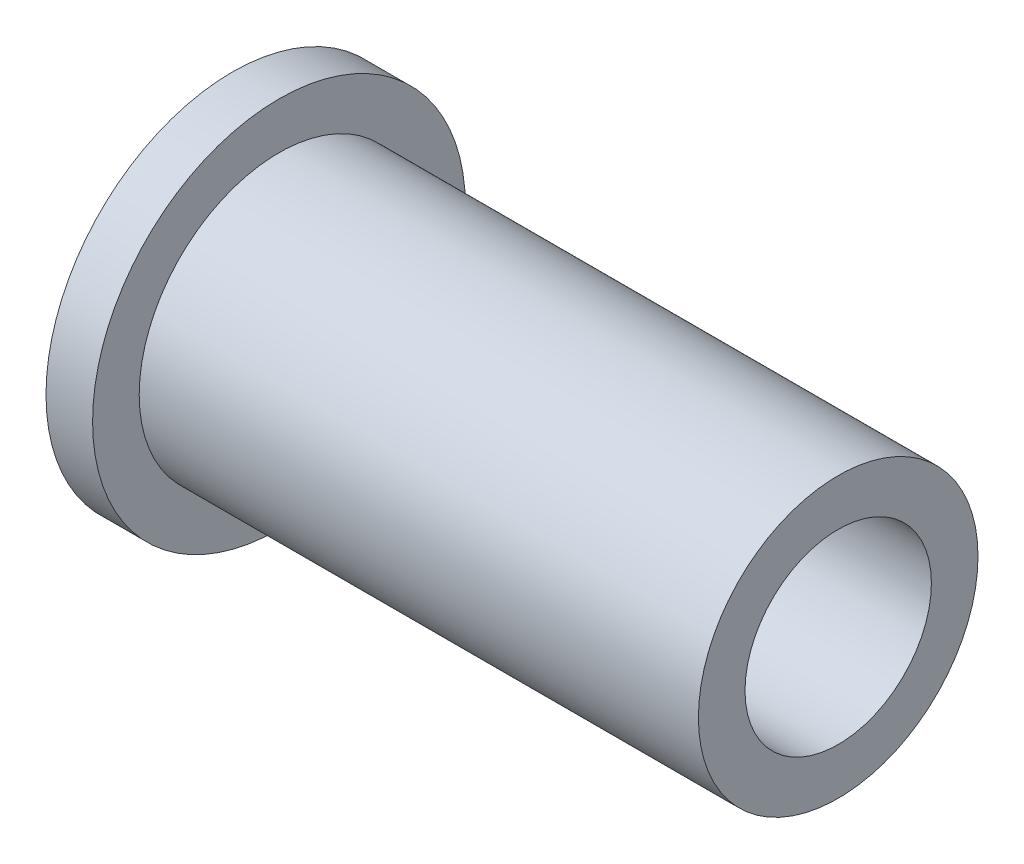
ISO-10303-21;
HEADER;
FILE_DESCRIPTION(('STEP AP214'),'2;1');
FILE_NAME('part.step','',(''),(''),'','','');
FILE_SCHEMA(('AUTOMOTIVE_DESIGN { 1 0 10303 214 1 1 1 1 }'));
ENDSEC;
DATA;
#1=APPLICATION_CONTEXT('core data for automotive mechanical design processes');
#2=APPLICATION_PROTOCOL_DEFINITION('international standard','automotive_design',2000,#1);
#3=PRODUCT_CONTEXT('',#1,'mechanical');
#4=PRODUCT('Part','Part','',(#3));
#5=PRODUCT_RELATED_PRODUCT_CATEGORY('part','',(#4));
#6=PRODUCT_DEFINITION_FORMATION('','',#4);
#7=PRODUCT_DEFINITION_CONTEXT('part definition',#1,'design');
#8=PRODUCT_DEFINITION('design','',#6,#7);
#9=PRODUCT_DEFINITION_SHAPE('','',#8);
#10=(LENGTH_UNIT() NAMED_UNIT(*) SI_UNIT(.MILLI.,.METRE.));
#11=(NAMED_UNIT(*) PLANE_ANGLE_UNIT() SI_UNIT($,.RADIAN.));
#12=(NAMED_UNIT(*) SI_UNIT($,.STERADIAN.) SOLID_ANGLE_UNIT());
#13=UNCERTAINTY_MEASURE_WITH_UNIT(LENGTH_MEASURE(1.E-05),#10,'distance_accuracy_value','');
#14=(GEOMETRIC_REPRESENTATION_CONTEXT(3) GLOBAL_UNCERTAINTY_ASSIGNED_CONTEXT((#13)) GLOBAL_UNIT_ASSIGNED_CONTEXT((#10,
#11,#12)) REPRESENTATION_CONTEXT('',''));
#15=CARTESIAN_POINT('',(0.,0.,0.));
#16=DIRECTION('',(0.,0.,1.));
#17=DIRECTION('',(1.,0.,0.));
#18=AXIS2_PLACEMENT_3D('',#15,#16,#17);
#19=CARTESIAN_POINT('',(-42.9,15.5,15.5));
#20=DIRECTION('',(-1.,0.,0.));
#21=DIRECTION('',(0.,0.,1.));
#22=AXIS2_PLACEMENT_3D('',#19,#20,#21);
#23=CYLINDRICAL_SURFACE('',#22,2.5);
#24=CARTESIAN_POINT('',(-43.9,15.5,15.5));
#25=DIRECTION('',(-1.,0.,0.));
#26=DIRECTION('',(0.,0.,1.));
#27=AXIS2_PLACEMENT_3D('',#24,#25,#26);
#28=CIRCLE('',#27,2.5);
#29=CARTESIAN_POINT('',(-43.9,15.5,18.));
#30=VERTEX_POINT('',#29);
#31=EDGE_CURVE('E18',#30,#30,#28,.T.);
#32=ORIENTED_EDGE('',*,*,#31,.T.);
#33=EDGE_LOOP('',(#32));
#34=FACE_BOUND('',#33,.T.);
#35=CARTESIAN_POINT('',(-41.9,15.5,15.5));
#36=DIRECTION('',(-1.,0.,0.));
#37=DIRECTION('',(0.,0.,1.));
#38=AXIS2_PLACEMENT_3D('',#35,#36,#37);
#39=CIRCLE('',#38,2.5);
#40=CARTESIAN_POINT('',(-41.9,15.5,18.));
#41=VERTEX_POINT('',#40);
#42=EDGE_CURVE('E40',#41,#41,#39,.T.);
#43=ORIENTED_EDGE('',*,*,#42,.F.);
#44=EDGE_LOOP('',(#43));
#45=FACE_BOUND('',#44,.T.);
#46=ADVANCED_FACE('F15',(#34,#45),#23,.F.);
#47=CARTESIAN_POINT('',(-43.9,15.5,15.5));
#48=DIRECTION('',(1.,0.,0.));
#49=DIRECTION('',(0.,0.,-1.));
#50=AXIS2_PLACEMENT_3D('',#47,#48,#49);
#51=PLANE('',#50);
#52=ORIENTED_EDGE('',*,*,#31,.F.);
#53=EDGE_LOOP('',(#52));
#54=FACE_BOUND('',#53,.T.);
#55=CARTESIAN_POINT('',(-43.9,15.5,15.5));
#56=DIRECTION('',(1.,0.,0.));
#57=DIRECTION('',(0.,0.,-1.));
#58=AXIS2_PLACEMENT_3D('',#55,#56,#57);
#59=CIRCLE('',#58,4.);
#60=CARTESIAN_POINT('',(-43.9,15.5,11.5));
#61=VERTEX_POINT('',#60);
#62=EDGE_CURVE('E38',#61,#61,#59,.T.);
#63=ORIENTED_EDGE('',*,*,#62,.F.);
#64=EDGE_LOOP('',(#63));
#65=FACE_BOUND('',#64,.T.);
#66=ADVANCED_FACE('F49',(#54,#65),#51,.F.);
#67=CARTESIAN_POINT('',(-41.9,15.5,15.5));
#68=DIRECTION('',(-1.,0.,0.));
#69=DIRECTION('',(0.,0.,1.));
#70=AXIS2_PLACEMENT_3D('',#67,#68,#69);
#71=PLANE('',#70);
#72=CARTESIAN_POINT('',(-41.9,15.5,15.5));
#73=DIRECTION('',(1.,0.,0.));
#74=DIRECTION('',(0.,0.,-1.));
#75=AXIS2_PLACEMENT_3D('',#72,#73,#74);
#76=CIRCLE('',#75,2.);
#77=CARTESIAN_POINT('',(-41.9,15.5,13.5));
#78=VERTEX_POINT('',#77);
#79=EDGE_CURVE('E35',#78,#78,#76,.T.);
#80=ORIENTED_EDGE('',*,*,#79,.T.);
#81=EDGE_LOOP('',(#80));
#82=FACE_BOUND('',#81,.T.);
#83=ORIENTED_EDGE('',*,*,#42,.T.);
#84=EDGE_LOOP('',(#83));
#85=FACE_BOUND('',#84,.T.);
#86=ADVANCED_FACE('F52',(#82,#85),#71,.T.);
#87=CARTESIAN_POINT('',(-43.4,15.5,15.5));
#88=DIRECTION('',(1.,0.,0.));
#89=DIRECTION('',(0.,0.,-1.));
#90=AXIS2_PLACEMENT_3D('',#87,#88,#89);
#91=CYLINDRICAL_SURFACE('',#90,4.);
#92=ORIENTED_EDGE('',*,*,#62,.T.);
#93=EDGE_LOOP('',(#92));
#94=FACE_BOUND('',#93,.T.);
#95=CARTESIAN_POINT('',(-42.9,15.5,15.5));
#96=DIRECTION('',(1.,0.,0.));
#97=DIRECTION('',(0.,0.,-1.));
#98=AXIS2_PLACEMENT_3D('',#95,#96,#97);
#99=CIRCLE('',#98,4.);
#100=CARTESIAN_POINT('',(-42.9,15.5,11.5));
#101=VERTEX_POINT('',#100);
#102=EDGE_CURVE('E32',#101,#101,#99,.T.);
#103=ORIENTED_EDGE('',*,*,#102,.F.);
#104=EDGE_LOOP('',(#103));
#105=FACE_BOUND('',#104,.T.);
#106=ADVANCED_FACE('F55',(#94,#105),#91,.T.);
#107=CARTESIAN_POINT('',(-37.9,15.5,15.5));
#108=DIRECTION('',(1.,0.,0.));
#109=DIRECTION('',(0.,0.,-1.));
#110=AXIS2_PLACEMENT_3D('',#107,#108,#109);
#111=CYLINDRICAL_SURFACE('',#110,2.);
#112=CARTESIAN_POINT('',(-30.9,15.5,15.5));
#113=DIRECTION('',(1.,0.,0.));
#114=DIRECTION('',(0.,0.,-1.));
#115=AXIS2_PLACEMENT_3D('',#112,#113,#114);
#116=CIRCLE('',#115,2.);
#117=CARTESIAN_POINT('',(-30.9,15.5,13.5));
#118=VERTEX_POINT('',#117);
#119=EDGE_CURVE('E27',#118,#118,#116,.F.);
#120=ORIENTED_EDGE('',*,*,#119,.F.);
#121=EDGE_LOOP('',(#120));
#122=FACE_BOUND('',#121,.T.);
#123=ORIENTED_EDGE('',*,*,#79,.F.);
#124=EDGE_LOOP('',(#123));
#125=FACE_BOUND('',#124,.T.);
#126=ADVANCED_FACE('F58',(#122,#125),#111,.F.);
#127=CARTESIAN_POINT('',(-42.9,15.5,15.5));
#128=DIRECTION('',(1.,0.,0.));
#129=DIRECTION('',(0.,0.,-1.));
#130=AXIS2_PLACEMENT_3D('',#127,#128,#129);
#131=PLANE('',#130);
#132=CARTESIAN_POINT('',(-42.9,15.5,15.5));
#133=DIRECTION('',(1.,0.,0.));
#134=DIRECTION('',(0.,0.,-1.));
#135=AXIS2_PLACEMENT_3D('',#132,#133,#134);
#136=CIRCLE('',#135,3.);
#137=CARTESIAN_POINT('',(-42.9,15.5,12.5));
#138=VERTEX_POINT('',#137);
#139=EDGE_CURVE('E22',#138,#138,#136,.T.);
#140=ORIENTED_EDGE('',*,*,#139,.F.);
#141=EDGE_LOOP('',(#140));
#142=FACE_BOUND('',#141,.T.);
#143=ORIENTED_EDGE('',*,*,#102,.T.);
#144=EDGE_LOOP('',(#143));
#145=FACE_BOUND('',#144,.T.);
#146=ADVANCED_FACE('F62',(#142,#145),#131,.T.);
#147=CARTESIAN_POINT('',(-30.9,15.5,15.5));
#148=DIRECTION('',(1.,0.,0.));
#149=DIRECTION('',(0.,0.,-1.));
#150=AXIS2_PLACEMENT_3D('',#147,#148,#149);
#151=PLANE('',#150);
#152=ORIENTED_EDGE('',*,*,#119,.T.);
#153=EDGE_LOOP('',(#152));
#154=FACE_BOUND('',#153,.T.);
#155=CARTESIAN_POINT('',(-30.9,15.5,15.5));
#156=DIRECTION('',(1.,0.,0.));
#157=DIRECTION('',(0.,0.,-1.));
#158=AXIS2_PLACEMENT_3D('',#155,#156,#157);
#159=CIRCLE('',#158,3.);
#160=CARTESIAN_POINT('',(-30.9,15.5,12.5));
#161=VERTEX_POINT('',#160);
#162=EDGE_CURVE('E10',#161,#161,#159,.F.);
#163=ORIENTED_EDGE('',*,*,#162,.F.);
#164=EDGE_LOOP('',(#163));
#165=FACE_BOUND('',#164,.T.);
#166=ADVANCED_FACE('F64',(#154,#165),#151,.T.);
#167=CARTESIAN_POINT('',(-36.9,15.5,15.5));
#168=DIRECTION('',(1.,0.,0.));
#169=DIRECTION('',(0.,0.,-1.));
#170=AXIS2_PLACEMENT_3D('',#167,#168,#169);
#171=CYLINDRICAL_SURFACE('',#170,3.);
#172=ORIENTED_EDGE('',*,*,#139,.T.);
#173=EDGE_LOOP('',(#172));
#174=FACE_BOUND('',#173,.T.);
#175=ORIENTED_EDGE('',*,*,#162,.T.);
#176=EDGE_LOOP('',(#175));
#177=FACE_BOUND('',#176,.T.);
#178=ADVANCED_FACE('F72',(#174,#177),#171,.T.);
#179=CLOSED_SHELL('',(#46,#66,#86,#106,#126,#146,#166,#178));
#180=MANIFOLD_SOLID_BREP('B1',#179);
#181=ADVANCED_BREP_SHAPE_REPRESENTATION('',(#18,#180),#14);
#182=SHAPE_DEFINITION_REPRESENTATION(#9,#181);
ENDSEC;
END-ISO-10303-21;
